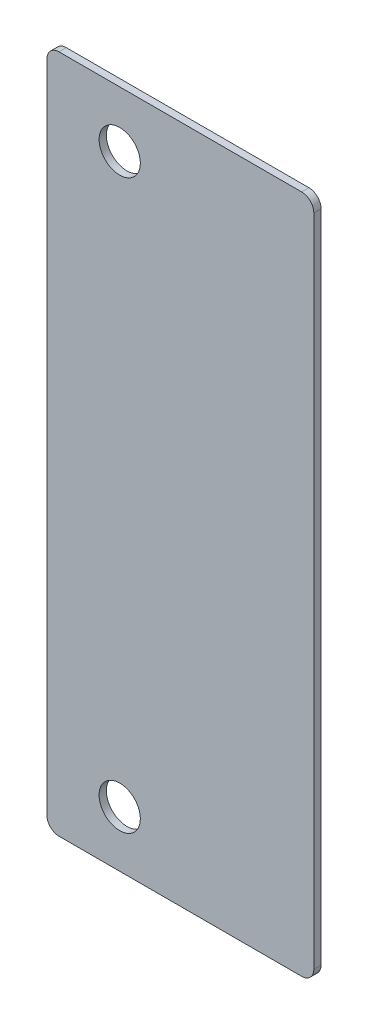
from build123d import *

# Parameters (mm, degrees)
ESQUISSE1_R      = 4.25
EXTRUSION1_DEPTH = 1.5


with BuildPart() as part:
    # Esquisse1 → Extrusion1 (new body)
    with BuildSketch(Plane.XY):
        with BuildLine():
            Line((2.5, 0), (52.5, 0))
            ThreePointArc((52.5, 0), (54.267766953, 0.732233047), (55, 2.5))
            Line((55, 2.5), (55, 137.5))
            ThreePointArc((55, 137.5), (54.267766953, 139.267766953), (52.5, 140))
            Line((52.5, 140), (2.5, 140))
            ThreePointArc((2.5, 140), (0.732233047, 139.267766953), (0, 137.5))
            Line((0, 137.5), (0, 2.5))
            ThreePointArc((0, 2.5), (0.732233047, 0.732233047), (2.5, 0))
        make_face()
        with Locations((15, 128.5)):
            Circle(ESQUISSE1_R, mode=Mode.SUBTRACT)
        with Locations((15, 11.5)):
            Circle(ESQUISSE1_R, mode=Mode.SUBTRACT)
    extrude(amount=EXTRUSION1_DEPTH)


solid = part.part
